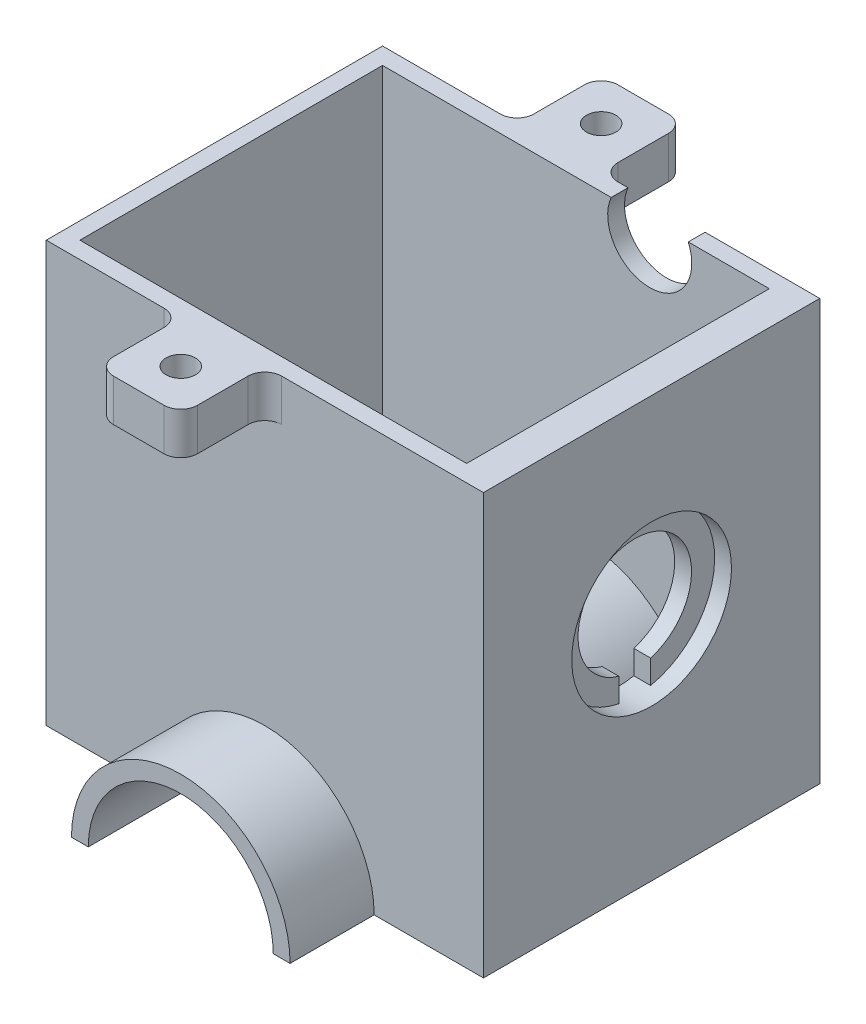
from build123d import *

# Parameters (mm, degrees)
BOSS_EXTRUDE1_DEPTH = 40
SHELL1_T            = -2
BOSS_EXTRUDE2_START = 36
BOSS_EXTRUDE2_DEPTH = 36
BOSS_EXTRUDE3_START = 36
BOSS_EXTRUDE3_DEPTH = 36
CUT_EXTRUDE1_DEPTH  = 36
CUT_EXTRUDE2_DEPTH  = 3
CUT_EXTRUDE3_DEPTH  = 11
SKETCH9_R           = 1.27
CUT_EXTRUDE4_DEPTH  = 61.373835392
SKETCH10_R          = 2.5
CUT_EXTRUDE5_DEPTH  = 11
SKETCH12_W          = 2
SKETCH12_H          = 36
BOSS_EXTRUDE4_DEPTH = 45
SKETCH14_R          = 6.75
CUT_EXTRUDE6_DEPTH  = 81.024996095
SKETCH15_R          = 9.5
CUT_EXTRUDE7_DEPTH  = 2
SKETCH16_W          = 10
SKETCH16_H          = 5
BOSS_EXTRUDE5_DEPTH = 10
SKETCH17_W          = 10
SKETCH17_H          = 5
BOSS_EXTRUDE6_DEPTH = 10
CUT_EXTRUDE8_DEPTH  = 2
SKETCH20_R          = 1.75
CUT_EXTRUDE9_DEPTH  = 74.382559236
FILLET1_R           = 2
CUT_EXTRUDE12_DEPTH = 10
CUT_EXTRUDE13_DEPTH = 10
BOSS_EXTRUDE8_START = 10
BOSS_EXTRUDE8_DEPTH = 10
BOSS_EXTRUDE9_DEPTH = 10


with BuildPart() as part:
    # Sketch1 → Boss-Extrude1 (new body)
    with BuildSketch(Plane.XY):
        with BuildLine():
            Line((11, 0), (16, 0))
            Line((16, 0), (26, 0))
            Line((26, 0), (26, 50))
            Line((26, 50), (-26, 50))
            Line((-26, 50), (-26, 0))
            Line((-26, 0), (-16, 0))
            Line((-16, 0), (-11, 0))
            ThreePointArc((-11, 0), (0, 11), (11, 0))
        make_face()
    extrude(amount=BOSS_EXTRUDE1_DEPTH)

    # Shell1
    shell1_openings = [part.faces().sort_by_distance(p)[0] for p in [
        (0, 50, 20),
    ]]
    offset(amount=SHELL1_T, openings=shell1_openings, kind=Kind.INTERSECTION)

    # Sketch2 → Boss-Extrude2 (add)
    with BuildSketch(Plane(origin=(0, 0, 38), x_dir=(-1, 0, 0), z_dir=(0, 0, -1)).offset(BOSS_EXTRUDE2_START)):
        with BuildLine():
            Line((24, 13), (0, 13))
            ThreePointArc((0, 13), (8.455767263, 9.874208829), (12.845232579, 2))
            Line((12.845232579, 2), (24, 2))
            Line((24, 2), (24, 13))
        make_face()
    extrude(amount=-BOSS_EXTRUDE2_DEPTH)

    # Sketch4 → Boss-Extrude3 (add)
    with BuildSketch(Plane(origin=(0, 0, 38), x_dir=(-1, 0, 0), z_dir=(0, 0, -1)).offset(BOSS_EXTRUDE3_START)):
        with BuildLine():
            Line((-24, 5), (-24, 2))
            Line((-24, 2), (-12.845232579, 2))
            ThreePointArc((-12.845232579, 2), (-12.512849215, 3.525422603), (-12, 5))
            Line((-12, 5), (-24, 5))
        make_face()
    extrude(amount=-BOSS_EXTRUDE3_DEPTH)

    # Sketch3 → Cut-Extrude1 (cut)
    with BuildSketch(Plane.XZ):
        with BuildLine():
            ThreePointArc((20.5, 20), (19.639189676, 21.643851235), (17.797753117, 21.872658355))
            Line((17.797753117, 21.872658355), (19.202246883, 18.127341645))
            ThreePointArc((19.202246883, 18.127341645), (20.143851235, 18.860810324), (20.5, 20))
        make_face()
        with BuildLine():
            Line((19.202246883, 18.127341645), (17.797753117, 21.872658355))
            ThreePointArc((17.797753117, 21.872658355), (16.627341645, 19.297753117), (19.202246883, 18.127341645))
        make_face()
        with BuildLine():
            ThreePointArc((20.5, 20), (19.639189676, 21.643851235), (17.797753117, 21.872658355))
            Line((17.797753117, 21.872658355), (19.202246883, 18.127341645))
            ThreePointArc((19.202246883, 18.127341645), (20.143851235, 18.860810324), (20.5, 20))
        make_face()
        with BuildLine():
            Line((19.202246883, 18.127341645), (17.797753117, 21.872658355))
            ThreePointArc((17.797753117, 21.872658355), (16.627341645, 19.297753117), (19.202246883, 18.127341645))
        make_face()
        with BuildLine():
            ThreePointArc((-16.5, 20), (-17.360810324, 21.643851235), (-19.202246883, 21.872658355))
            Line((-19.202246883, 21.872658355), (-17.797753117, 18.127341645))
            ThreePointArc((-17.797753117, 18.127341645), (-16.856148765, 18.860810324), (-16.5, 20))
        make_face()
        with BuildLine():
            Line((-17.797753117, 18.127341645), (-19.202246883, 21.872658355))
            ThreePointArc((-19.202246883, 21.872658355), (-20.372658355, 19.297753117), (-17.797753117, 18.127341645))
        make_face()
        with BuildLine():
            ThreePointArc((-16.5, 20), (-17.360810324, 21.643851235), (-19.202246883, 21.872658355))
            Line((-19.202246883, 21.872658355), (-17.797753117, 18.127341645))
            ThreePointArc((-17.797753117, 18.127341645), (-16.856148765, 18.860810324), (-16.5, 20))
        make_face()
        with BuildLine():
            Line((-17.797753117, 18.127341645), (-19.202246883, 21.872658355))
            ThreePointArc((-19.202246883, 21.872658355), (-20.372658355, 19.297753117), (-17.797753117, 18.127341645))
        make_face()
    extrude(amount=-CUT_EXTRUDE1_DEPTH, mode=Mode.SUBTRACT)

    # Sketch5 → Cut-Extrude2 (cut)
    with BuildSketch(Plane(origin=(0, 5, 0), x_dir=(1, 0, 0), z_dir=(0, 1, 0))):
        Polygon((18.5, -23.464101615), (21.5, -21.732050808), (21.5, -18.267949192), (18.5, -16.535898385), (15.5, -18.267949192), (15.5, -21.732050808), align=None)
    extrude(amount=-CUT_EXTRUDE2_DEPTH, mode=Mode.SUBTRACT)

    # Sketch7 → Cut-Extrude3 (cut)
    with BuildSketch(Plane(origin=(0, 13, 0), x_dir=(1, 0, 0), z_dir=(0, 1, 0))):
        Polygon((-18.090867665, -23.439856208), (-15.316430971, -21.365609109), (-15.725563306, -17.925752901), (-18.909132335, -16.560143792), (-21.683569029, -18.634390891), (-21.274436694, -22.074247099), align=None)
    extrude(amount=-CUT_EXTRUDE3_DEPTH, mode=Mode.SUBTRACT)

    # Sketch9 → Cut-Extrude4 (cut, through all)
    with BuildSketch(Plane(origin=(0, 13, 0), x_dir=(1, 0, 0), z_dir=(0, 1, 0))):
        with Locations(Location((-17.081974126, -12.38, 0), (0, 0, 270))):
            Circle(SKETCH9_R)
        with Locations(Location((-17.081974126, -27.62, 0), (0, 0, 270))):
            Circle(SKETCH9_R)
    extrude(amount=-CUT_EXTRUDE4_DEPTH, mode=Mode.SUBTRACT)

    # Sketch10 → Cut-Extrude5 (cut)
    with BuildSketch(Plane.XZ):
        with Locations((-17.081974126, 27.62)):
            Circle(SKETCH10_R)
        with Locations((-17.081974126, 12.38)):
            Circle(SKETCH10_R)
    extrude(amount=-CUT_EXTRUDE5_DEPTH, mode=Mode.SUBTRACT)

    # Sketch12 → Boss-Extrude4 (add)
    with BuildSketch(Plane(origin=(0, 5, 0), x_dir=(1, 0, 0), z_dir=(0, 1, 0))):
        with Locations((23, -20)):
            Rectangle(SKETCH12_W, SKETCH12_H)
    extrude(amount=BOSS_EXTRUDE4_DEPTH)

    # Sketch14 → Cut-Extrude6 (cut, through all)
    with BuildSketch(Plane.ZY.offset(-22)):
        with Locations((20, 27.5)):
            Circle(SKETCH14_R)
    extrude(amount=-CUT_EXTRUDE6_DEPTH, mode=Mode.SUBTRACT)

    # Sketch15 → Cut-Extrude7 (cut)
    with BuildSketch(Plane(origin=(26, 0, 0), x_dir=(0, 0, -1), z_dir=(1, 0, 0))):
        with Locations(Location((-20, 27.5, 0), (0, 0, 90))):
            Circle(SKETCH15_R)
    extrude(amount=-CUT_EXTRUDE7_DEPTH, mode=Mode.SUBTRACT)

    # Sketch16 → Boss-Extrude5 (add)
    with BuildSketch(Plane(origin=(0, 0, 0), x_dir=(-1, 0, 0), z_dir=(0, 0, -1))):
        with Locations((5, 47.5)):
            Rectangle(SKETCH16_W, SKETCH16_H)
    extrude(amount=BOSS_EXTRUDE5_DEPTH)

    # Sketch17 → Boss-Extrude6 (add)
    with BuildSketch(Plane.XY.offset(40)):
        with Locations((-5, 47.5)):
            Rectangle(SKETCH17_W, SKETCH17_H)
    extrude(amount=BOSS_EXTRUDE6_DEPTH)

    # Sketch18 → Cut-Extrude8 (cut)
    with BuildSketch(Plane.XZ.offset(-45)):
        Polygon((-3.947376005, 48.300300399), (-7.331831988, 47.56174932), (-8.384455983, 44.261448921), (-6.052623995, 41.699699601), (-2.668168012, 42.43825068), (-1.615544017, 45.738551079), align=None)
        Polygon((-4.166968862, -1.637551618), (-7.495450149, -2.597349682), (-8.328481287, -5.959798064), (-5.833031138, -8.362448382), (-2.504549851, -7.402650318), (-1.671518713, -4.040201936), align=None)
    extrude(amount=-CUT_EXTRUDE8_DEPTH, mode=Mode.SUBTRACT)

    # Sketch20 → Cut-Extrude9 (cut, through all)
    with BuildSketch(Plane.XZ.offset(-47)):
        with Locations(Location((-5, 45, 0), (0, 0, 270))):
            Circle(SKETCH20_R)
        with Locations(Location((-5, -5, 0), (0, 0, 270))):
            Circle(SKETCH20_R)
    extrude(amount=-CUT_EXTRUDE9_DEPTH, mode=Mode.SUBTRACT)

    # Fillet1
    fillet1_edges = [part.edges().sort_by_distance(p)[0] for p in [
        (0, 47.5, 0),
        (-10, 47.5, 0),
        (0, 47.5, -10),
        (-10, 47.5, -10),
        (0, 47.5, 40),
        (-10, 47.5, 40),
        (0, 47.5, 50),
        (-10, 47.5, 50),
    ]]
    fillet(fillet1_edges, radius=FILLET1_R)

    # Sketch22 → Cut-Extrude12 (cut)
    with BuildSketch(Plane(origin=(24, 0, 0), x_dir=(0, 0, -1), z_dir=(1, 0, 0))):
        with BuildLine():
            ThreePointArc((-18.118542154, 21.017514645), (-20, 20.75), (-21.881457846, 21.017514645))
            Line((-21.881457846, 21.017514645), (-21.881457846, 18.188173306))
            ThreePointArc((-21.881457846, 18.188173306), (-20, 18), (-18.118542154, 18.188173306))
            Line((-18.118542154, 18.188173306), (-18.118542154, 21.017514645))
        make_face()
    extrude(amount=-CUT_EXTRUDE12_DEPTH, mode=Mode.SUBTRACT)

    # Sketch24 → Cut-Extrude13 (cut)
    with BuildSketch(Plane(origin=(0, 0, 0), x_dir=(-1, 0, 0), z_dir=(0, 0, -1))):
        with BuildLine():
            Line((-3.194816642, 50), (-12.359968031, 50))
            ThreePointArc((-12.359968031, 50), (-12.671923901, 49.021548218), (-12.777392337, 48))
            Line((-12.777392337, 48), (-2.777392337, 48))
            ThreePointArc((-2.777392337, 48), (-2.882860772, 49.021548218), (-3.194816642, 50))
        make_face()
        with BuildLine():
            Line((-2.777392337, 48), (-12.777392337, 48))
            ThreePointArc((-12.777392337, 48), (-7.777392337, 43), (-2.777392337, 48))
        make_face()
    extrude(amount=-CUT_EXTRUDE13_DEPTH, mode=Mode.SUBTRACT)

    # Sketch25 → Boss-Extrude8 (add)
    with BuildSketch(Plane(origin=(0, 0, 0), x_dir=(-1, 0, 0), z_dir=(0, 0, -1)).offset(BOSS_EXTRUDE8_START)):
        with BuildLine():
            ThreePointArc((13, 0), (0, 13), (-13, 0))
            Line((-13, 0), (-11, 0))
            ThreePointArc((-11, 0), (0, 11), (11, 0))
            Line((11, 0), (13, 0))
        make_face()
    extrude(amount=-BOSS_EXTRUDE8_DEPTH)

    # Sketch26 → Boss-Extrude9 (add)
    with BuildSketch(Plane.XY.offset(40)):
        with BuildLine():
            ThreePointArc((13, 0), (0, 13), (-13, 0))
            Line((-13, 0), (-11, 0))
            ThreePointArc((-11, 0), (0, 11), (11, 0))
            Line((11, 0), (13, 0))
        make_face()
    extrude(amount=BOSS_EXTRUDE9_DEPTH)


solid = part.part
